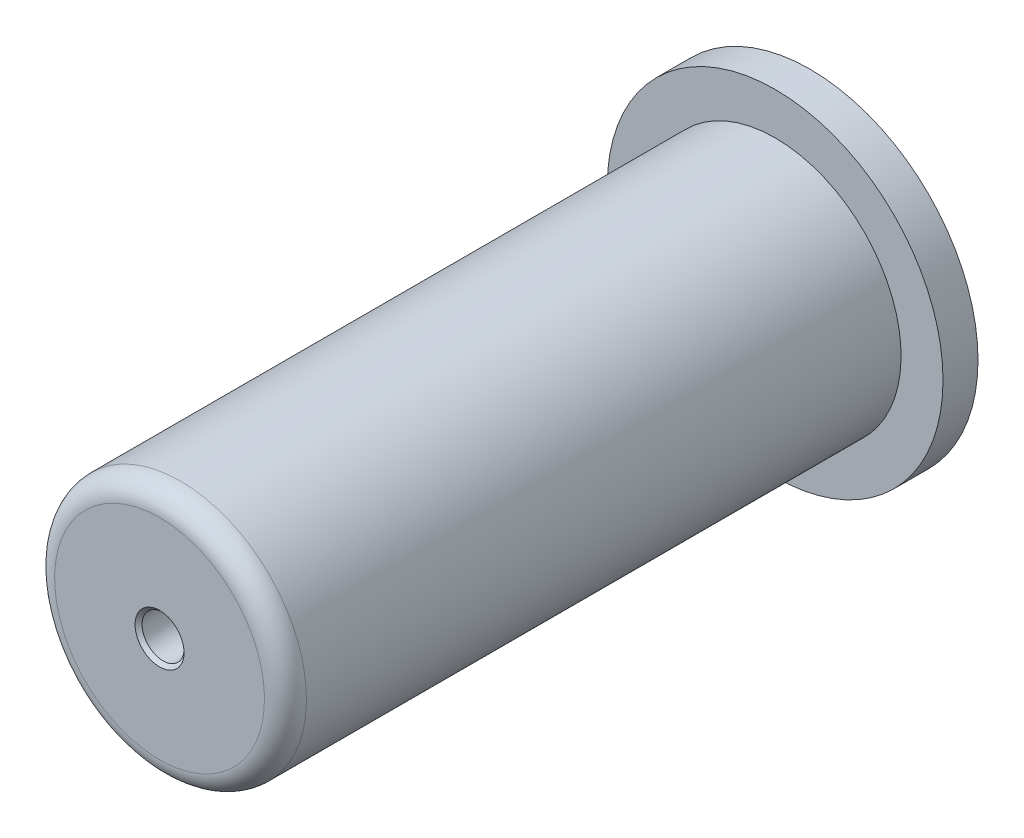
ISO-10303-21;
HEADER;
FILE_DESCRIPTION(('STEP AP214'),'2;1');
FILE_NAME('part.step','',(''),(''),'','','');
FILE_SCHEMA(('AUTOMOTIVE_DESIGN { 1 0 10303 214 1 1 1 1 }'));
ENDSEC;
DATA;
#1=APPLICATION_CONTEXT('core data for automotive mechanical design processes');
#2=APPLICATION_PROTOCOL_DEFINITION('international standard','automotive_design',2000,#1);
#3=PRODUCT_CONTEXT('',#1,'mechanical');
#4=PRODUCT('Part','Part','',(#3));
#5=PRODUCT_RELATED_PRODUCT_CATEGORY('part','',(#4));
#6=PRODUCT_DEFINITION_FORMATION('','',#4);
#7=PRODUCT_DEFINITION_CONTEXT('part definition',#1,'design');
#8=PRODUCT_DEFINITION('design','',#6,#7);
#9=PRODUCT_DEFINITION_SHAPE('','',#8);
#10=(LENGTH_UNIT() NAMED_UNIT(*) SI_UNIT(.MILLI.,.METRE.));
#11=(NAMED_UNIT(*) PLANE_ANGLE_UNIT() SI_UNIT($,.RADIAN.));
#12=(NAMED_UNIT(*) SI_UNIT($,.STERADIAN.) SOLID_ANGLE_UNIT());
#13=UNCERTAINTY_MEASURE_WITH_UNIT(LENGTH_MEASURE(1.E-05),#10,'distance_accuracy_value','');
#14=(GEOMETRIC_REPRESENTATION_CONTEXT(3) GLOBAL_UNCERTAINTY_ASSIGNED_CONTEXT((#13)) GLOBAL_UNIT_ASSIGNED_CONTEXT((#10,
#11,#12)) REPRESENTATION_CONTEXT('',''));
#15=CARTESIAN_POINT('',(0.,0.,0.));
#16=DIRECTION('',(0.,0.,1.));
#17=DIRECTION('',(1.,0.,0.));
#18=AXIS2_PLACEMENT_3D('',#15,#16,#17);
#19=CARTESIAN_POINT('',(0.,0.,0.));
#20=DIRECTION('',(0.,0.,-1.));
#21=DIRECTION('',(0.,1.,0.));
#22=AXIS2_PLACEMENT_3D('',#19,#20,#21);
#23=PLANE('',#22);
#24=CARTESIAN_POINT('',(0.,0.,0.));
#25=DIRECTION('',(0.,0.,-1.));
#26=DIRECTION('',(0.,1.,0.));
#27=AXIS2_PLACEMENT_3D('',#24,#25,#26);
#28=CIRCLE('',#27,24.);
#29=CARTESIAN_POINT('',(0.,24.,0.));
#30=VERTEX_POINT('',#29);
#31=EDGE_CURVE('E11',#30,#30,#28,.T.);
#32=ORIENTED_EDGE('',*,*,#31,.T.);
#33=EDGE_LOOP('',(#32));
#34=FACE_BOUND('',#33,.T.);
#35=ADVANCED_FACE('F32',(#34),#23,.T.);
#36=CARTESIAN_POINT('',(0.,0.,0.));
#37=DIRECTION('',(0.,0.,-1.));
#38=DIRECTION('',(0.,1.,0.));
#39=AXIS2_PLACEMENT_3D('',#36,#37,#38);
#40=CYLINDRICAL_SURFACE('',#39,24.);
#41=CARTESIAN_POINT('',(0.,0.,5.));
#42=DIRECTION('',(0.,0.,-1.));
#43=DIRECTION('',(0.,1.,0.));
#44=AXIS2_PLACEMENT_3D('',#41,#42,#43);
#45=CIRCLE('',#44,24.);
#46=CARTESIAN_POINT('',(0.,24.,5.));
#47=VERTEX_POINT('',#46);
#48=EDGE_CURVE('E38',#47,#47,#45,.T.);
#49=ORIENTED_EDGE('',*,*,#48,.T.);
#50=EDGE_LOOP('',(#49));
#51=FACE_BOUND('',#50,.T.);
#52=ORIENTED_EDGE('',*,*,#31,.F.);
#53=EDGE_LOOP('',(#52));
#54=FACE_BOUND('',#53,.T.);
#55=ADVANCED_FACE('F69',(#51,#54),#40,.T.);
#56=CARTESIAN_POINT('',(0.,24.,5.));
#57=DIRECTION('',(0.,0.,1.));
#58=DIRECTION('',(0.,-1.,0.));
#59=AXIS2_PLACEMENT_3D('',#56,#57,#58);
#60=PLANE('',#59);
#61=CARTESIAN_POINT('',(0.,0.,5.));
#62=DIRECTION('',(0.,0.,-1.));
#63=DIRECTION('',(0.,1.,0.));
#64=AXIS2_PLACEMENT_3D('',#61,#62,#63);
#65=CIRCLE('',#64,18.);
#66=CARTESIAN_POINT('',(0.,18.,5.));
#67=VERTEX_POINT('',#66);
#68=EDGE_CURVE('E64',#67,#67,#65,.T.);
#69=ORIENTED_EDGE('',*,*,#68,.T.);
#70=EDGE_LOOP('',(#69));
#71=FACE_BOUND('',#70,.T.);
#72=ORIENTED_EDGE('',*,*,#48,.F.);
#73=EDGE_LOOP('',(#72));
#74=FACE_BOUND('',#73,.T.);
#75=ADVANCED_FACE('F72',(#71,#74),#60,.T.);
#76=CARTESIAN_POINT('',(0.,0.,0.));
#77=DIRECTION('',(0.,0.,-1.));
#78=DIRECTION('',(0.,1.,0.));
#79=AXIS2_PLACEMENT_3D('',#76,#77,#78);
#80=CYLINDRICAL_SURFACE('',#79,18.);
#81=CARTESIAN_POINT('',(0.,0.,90.));
#82=DIRECTION('',(0.,0.,-1.));
#83=DIRECTION('',(0.,1.,0.));
#84=AXIS2_PLACEMENT_3D('',#81,#82,#83);
#85=CIRCLE('',#84,18.);
#86=CARTESIAN_POINT('',(0.,18.,90.));
#87=VERTEX_POINT('',#86);
#88=EDGE_CURVE('E61',#87,#87,#85,.T.);
#89=ORIENTED_EDGE('',*,*,#88,.T.);
#90=EDGE_LOOP('',(#89));
#91=FACE_BOUND('',#90,.T.);
#92=ORIENTED_EDGE('',*,*,#68,.F.);
#93=EDGE_LOOP('',(#92));
#94=FACE_BOUND('',#93,.T.);
#95=ADVANCED_FACE('F74',(#91,#94),#80,.T.);
#96=CARTESIAN_POINT('',(0.,0.,90.));
#97=DIRECTION('',(0.,0.,-1.));
#98=DIRECTION('',(0.,1.,0.));
#99=AXIS2_PLACEMENT_3D('',#96,#97,#98);
#100=TOROIDAL_SURFACE('',#99,15.,3.);
#101=CARTESIAN_POINT('',(0.,0.,93.));
#102=DIRECTION('',(0.,0.,-1.));
#103=DIRECTION('',(0.,1.,0.));
#104=AXIS2_PLACEMENT_3D('',#101,#102,#103);
#105=CIRCLE('',#104,15.);
#106=CARTESIAN_POINT('',(0.,15.,93.));
#107=VERTEX_POINT('',#106);
#108=EDGE_CURVE('E58',#107,#107,#105,.T.);
#109=ORIENTED_EDGE('',*,*,#108,.T.);
#110=EDGE_LOOP('',(#109));
#111=FACE_BOUND('',#110,.T.);
#112=ORIENTED_EDGE('',*,*,#88,.F.);
#113=EDGE_LOOP('',(#112));
#114=FACE_BOUND('',#113,.T.);
#115=ADVANCED_FACE('F81',(#111,#114),#100,.T.);
#116=CARTESIAN_POINT('',(0.,15.,93.));
#117=DIRECTION('',(0.,0.,1.));
#118=DIRECTION('',(0.,-1.,0.));
#119=AXIS2_PLACEMENT_3D('',#116,#117,#118);
#120=PLANE('',#119);
#121=CARTESIAN_POINT('',(0.,0.,93.));
#122=DIRECTION('',(0.,0.,-1.));
#123=DIRECTION('',(0.,1.,0.));
#124=AXIS2_PLACEMENT_3D('',#121,#122,#123);
#125=CIRCLE('',#124,3.49999999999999);
#126=CARTESIAN_POINT('',(0.,3.49999999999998,93.));
#127=VERTEX_POINT('',#126);
#128=EDGE_CURVE('E53',#127,#127,#125,.T.);
#129=ORIENTED_EDGE('',*,*,#128,.T.);
#130=EDGE_LOOP('',(#129));
#131=FACE_BOUND('',#130,.T.);
#132=ORIENTED_EDGE('',*,*,#108,.F.);
#133=EDGE_LOOP('',(#132));
#134=FACE_BOUND('',#133,.T.);
#135=ADVANCED_FACE('F112',(#131,#134),#120,.T.);
#136=CARTESIAN_POINT('',(0.,0.,93.));
#137=DIRECTION('',(0.,0.,1.));
#138=DIRECTION('',(0.,-1.,0.));
#139=AXIS2_PLACEMENT_3D('',#136,#137,#138);
#140=CONICAL_SURFACE('',#139,3.49999999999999,0.785398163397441);
#141=CARTESIAN_POINT('',(0.,0.,92.5));
#142=DIRECTION('',(0.,0.,-1.));
#143=DIRECTION('',(0.,1.,0.));
#144=AXIS2_PLACEMENT_3D('',#141,#142,#143);
#145=CIRCLE('',#144,3.);
#146=CARTESIAN_POINT('',(0.,2.99999999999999,92.5));
#147=VERTEX_POINT('',#146);
#148=EDGE_CURVE('E50',#147,#147,#145,.T.);
#149=ORIENTED_EDGE('',*,*,#148,.T.);
#150=EDGE_LOOP('',(#149));
#151=FACE_BOUND('',#150,.T.);
#152=ORIENTED_EDGE('',*,*,#128,.F.);
#153=EDGE_LOOP('',(#152));
#154=FACE_BOUND('',#153,.T.);
#155=ADVANCED_FACE('F122',(#151,#154),#140,.F.);
#156=CARTESIAN_POINT('',(0.,0.,0.));
#157=DIRECTION('',(0.,0.,-1.));
#158=DIRECTION('',(0.,1.,0.));
#159=AXIS2_PLACEMENT_3D('',#156,#157,#158);
#160=CYLINDRICAL_SURFACE('',#159,3.);
#161=CARTESIAN_POINT('',(0.,0.,84.));
#162=DIRECTION('',(0.,0.,-1.));
#163=DIRECTION('',(0.,1.,0.));
#164=AXIS2_PLACEMENT_3D('',#161,#162,#163);
#165=CIRCLE('',#164,3.);
#166=CARTESIAN_POINT('',(0.,2.99999999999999,84.));
#167=VERTEX_POINT('',#166);
#168=EDGE_CURVE('E48',#167,#167,#165,.T.);
#169=ORIENTED_EDGE('',*,*,#168,.T.);
#170=EDGE_LOOP('',(#169));
#171=FACE_BOUND('',#170,.T.);
#172=ORIENTED_EDGE('',*,*,#148,.F.);
#173=EDGE_LOOP('',(#172));
#174=FACE_BOUND('',#173,.T.);
#175=ADVANCED_FACE('F44',(#171,#174),#160,.F.);
#176=CARTESIAN_POINT('',(0.,0.,84.));
#177=DIRECTION('',(0.,0.,1.));
#178=DIRECTION('',(0.,-1.,0.));
#179=AXIS2_PLACEMENT_3D('',#176,#177,#178);
#180=CONICAL_SURFACE('',#179,3.,1.04719755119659);
#181=CARTESIAN_POINT('',(0.,0.,82.2679491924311));
#182=VERTEX_POINT('',#181);
#183=VERTEX_LOOP('',#182);
#184=FACE_BOUND('',#183,.T.);
#185=ORIENTED_EDGE('',*,*,#168,.F.);
#186=EDGE_LOOP('',(#185));
#187=FACE_BOUND('',#186,.T.);
#188=ADVANCED_FACE('F41',(#184,#187),#180,.F.);
#189=CLOSED_SHELL('',(#35,#55,#75,#95,#115,#135,#155,#175,#188));
#190=MANIFOLD_SOLID_BREP('B2',#189);
#191=ADVANCED_BREP_SHAPE_REPRESENTATION('',(#18,#190),#14);
#192=SHAPE_DEFINITION_REPRESENTATION(#9,#191);
ENDSEC;
END-ISO-10303-21;
